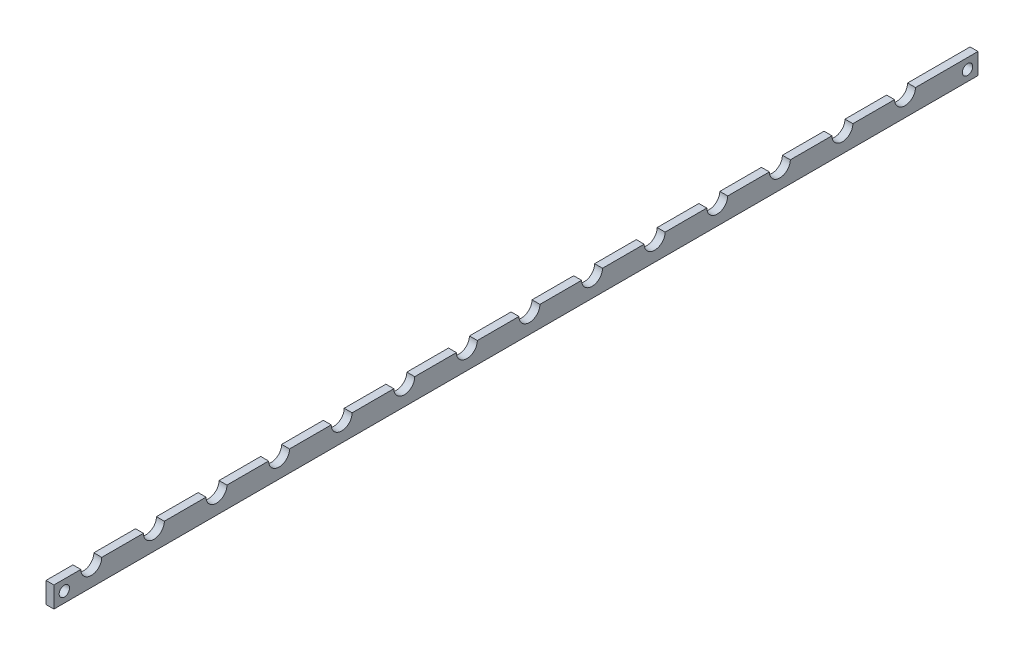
from build123d import *

# Parameters (mm, degrees)
CROQUIS1_W              = 561
CROQUIS1_H              = 12.7
SALIENTE_EXTRUIR1_DEPTH = 4.8
CROQUIS3_R              = 6.35
DESC_TUBERIA_DEPTH      = 562.164262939
MATRIZL1_COUNT          = 14
MATRIZL1_PITCH          = 38
CROQUIS5_R              = 3.15
CORTAR_EXTRUIR2_DEPTH   = 562.164262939


with BuildPart() as part:
    # Croquis1 → Saliente-Extruir1 (new body)
    with BuildSketch(Plane(origin=(0, 0, 0), x_dir=(0, 0, -1), z_dir=(1, 0, 0))):
        with Locations((280.5, -6.35)):
            Rectangle(CROQUIS1_W, CROQUIS1_H)
    extrude(amount=SALIENTE_EXTRUIR1_DEPTH)

    # Croquis3 → DESC_TUBERIA (cut, through all)
    with BuildSketch(Plane(origin=(4.8, 0, 0), x_dir=(0, 0, -1), z_dir=(1, 0, 0))):
        with Locations((516.7, 0)):
            Circle(CROQUIS3_R)
    desc_tuberia = extrude(amount=-DESC_TUBERIA_DEPTH, mode=Mode.SUBTRACT)

    # MatrizL1: DESC_TUBERIA ×14
    with Locations(*[(0, 0, i * MATRIZL1_PITCH) for i in range(1, MATRIZL1_COUNT)]):
        add(desc_tuberia, mode=Mode.SUBTRACT)

    # Croquis5 → Cortar-Extruir2 (cut, through all)
    with BuildSketch(Plane(origin=(4.8, 0, 0), x_dir=(0, 0, -1), z_dir=(1, 0, 0))):
        with Locations((554.65, -6.35)):
            Circle(CROQUIS5_R)
        with Locations((6.35, -6.35)):
            Circle(CROQUIS5_R)
    extrude(amount=-CORTAR_EXTRUIR2_DEPTH, mode=Mode.SUBTRACT)


solid = part.part
